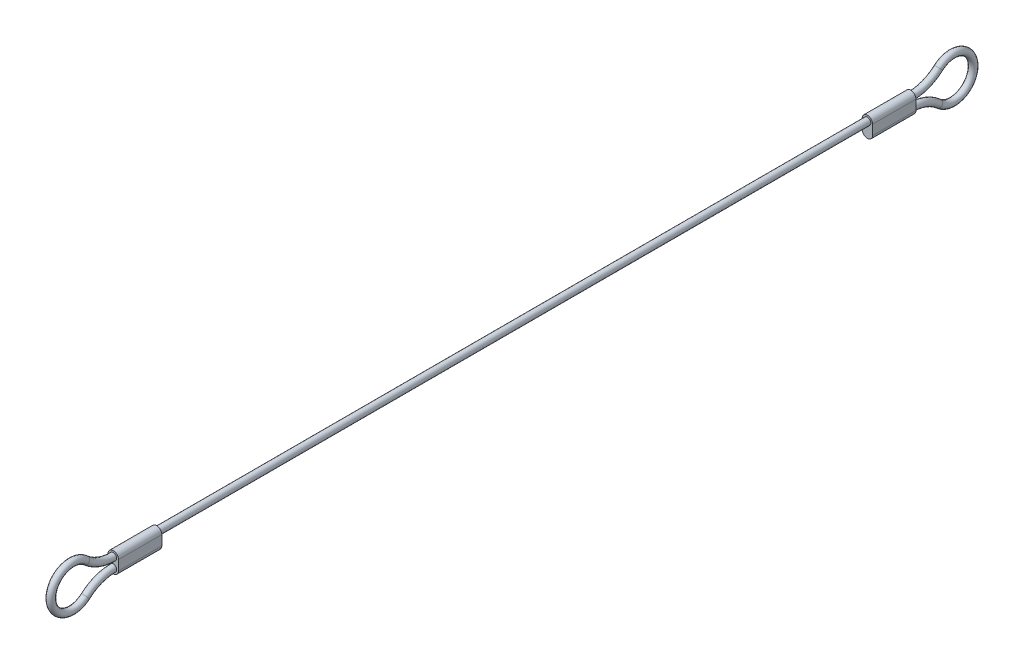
from build123d import *

# Parameters (mm, degrees)
SKETCH2_R           = 0.795
BOSS_EXTRUDE1_DEPTH = 10


with BuildPart() as part:
    # Sweep1: sweep along a path in Sketch1
    with BuildLine(Plane(origin=(0, 0, 0), x_dir=(0, 0, -1), z_dir=(1, 0, 0))) as sweep1_path:
        ThreePointArc((-92, -2.266252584), (-95.425492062, -2.898197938), (-98.4, -4.710835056))
        ThreePointArc((-98.4, -4.710835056), (-106.4, -1.133126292), (-98.4, 2.444582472))
        ThreePointArc((-98.4, 2.444582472), (-95.425492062, 0.631945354), (-92, 0))
        Line((-92, 0), (92, 0))
        ThreePointArc((92, 0), (95.425492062, 0.631945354), (98.4, 2.444582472))
        ThreePointArc((98.4, 2.444582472), (106.4, -1.133126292), (98.4, -4.710835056))
        ThreePointArc((98.4, -4.710835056), (95.425492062, -2.898197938), (92, -2.266252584))
    # Sketch2 → Sweep1 (sweep)
    with BuildSketch(Plane.XY):
        Circle(SKETCH2_R)
    sweep(path=sweep1_path.line)

    # Sketch3 → Boss-Extrude1 (add)
    with BuildSketch(Plane(origin=(0, 0, 92), x_dir=(-1, 0, 0), z_dir=(0, 0, -1))):
        with BuildLine():
            Line((1.2, 0), (1.2, -2.266252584))
            ThreePointArc((1.2, -2.266252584), (0, -3.466252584), (-1.2, -2.266252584))
            Line((-1.2, -2.266252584), (-1.2, 0))
            ThreePointArc((-1.2, 0), (0, 1.2), (1.2, 0))
        make_face()
    boss_extrude1 = extrude(amount=BOSS_EXTRUDE1_DEPTH)

    # Mirror1: Boss-Extrude1 across plane
    add(boss_extrude1.mirror(Plane.XY))


solid = part.part
